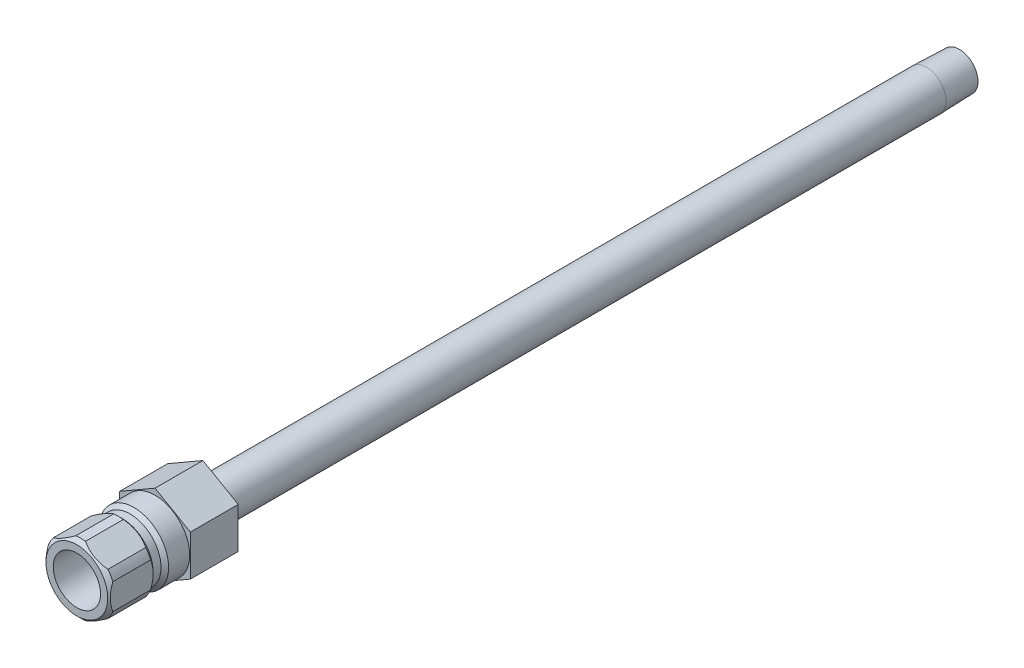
ISO-10303-21;
HEADER;
FILE_DESCRIPTION(('STEP AP214'),'2;1');
FILE_NAME('part.step','',(''),(''),'','','');
FILE_SCHEMA(('AUTOMOTIVE_DESIGN { 1 0 10303 214 1 1 1 1 }'));
ENDSEC;
DATA;
#1=APPLICATION_CONTEXT('core data for automotive mechanical design processes');
#2=APPLICATION_PROTOCOL_DEFINITION('international standard','automotive_design',2000,#1);
#3=PRODUCT_CONTEXT('',#1,'mechanical');
#4=PRODUCT('Part','Part','',(#3));
#5=PRODUCT_RELATED_PRODUCT_CATEGORY('part','',(#4));
#6=PRODUCT_DEFINITION_FORMATION('','',#4);
#7=PRODUCT_DEFINITION_CONTEXT('part definition',#1,'design');
#8=PRODUCT_DEFINITION('design','',#6,#7);
#9=PRODUCT_DEFINITION_SHAPE('','',#8);
#10=(LENGTH_UNIT() NAMED_UNIT(*) SI_UNIT(.MILLI.,.METRE.));
#11=(NAMED_UNIT(*) PLANE_ANGLE_UNIT() SI_UNIT($,.RADIAN.));
#12=(NAMED_UNIT(*) SI_UNIT($,.STERADIAN.) SOLID_ANGLE_UNIT());
#13=UNCERTAINTY_MEASURE_WITH_UNIT(LENGTH_MEASURE(1.E-05),#10,'distance_accuracy_value','');
#14=(GEOMETRIC_REPRESENTATION_CONTEXT(3) GLOBAL_UNCERTAINTY_ASSIGNED_CONTEXT((#13)) GLOBAL_UNIT_ASSIGNED_CONTEXT((#10,
#11,#12)) REPRESENTATION_CONTEXT('',''));
#15=CARTESIAN_POINT('',(0.,0.,0.));
#16=DIRECTION('',(0.,0.,1.));
#17=DIRECTION('',(1.,0.,0.));
#18=AXIS2_PLACEMENT_3D('',#15,#16,#17);
#19=CARTESIAN_POINT('',(0.,0.,-9.652));
#20=DIRECTION('',(0.,0.,-1.));
#21=DIRECTION('',(0.,1.,0.));
#22=AXIS2_PLACEMENT_3D('',#19,#20,#21);
#23=CYLINDRICAL_SURFACE('',#22,6.985);
#24=DIRECTION('',(0.,0.,-1.));
#25=VECTOR('',#24,1.);
#26=CARTESIAN_POINT('',(6.477,2.61509005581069,-9.652));
#27=LINE('',#26,#25);
#28=CARTESIAN_POINT('',(6.477,2.61509005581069,7.366));
#29=VERTEX_POINT('',#28);
#30=CARTESIAN_POINT('',(6.477,2.61509005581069,14.986));
#31=VERTEX_POINT('',#30);
#32=EDGE_CURVE('E381',#29,#31,#27,.F.);
#33=ORIENTED_EDGE('',*,*,#32,.F.);
#34=CARTESIAN_POINT('',(0.,0.,7.366));
#35=DIRECTION('',(0.,0.,-1.));
#36=DIRECTION('',(0.,1.,0.));
#37=AXIS2_PLACEMENT_3D('',#34,#35,#36);
#38=CIRCLE('',#37,6.985);
#39=CARTESIAN_POINT('',(5.50323442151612,4.30170151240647,7.366));
#40=VERTEX_POINT('',#39);
#41=EDGE_CURVE('E190',#40,#29,#38,.T.);
#42=ORIENTED_EDGE('',*,*,#41,.F.);
#43=DIRECTION('',(0.,0.,-1.));
#44=VECTOR('',#43,1.);
#45=CARTESIAN_POINT('',(5.50323442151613,4.30170151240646,-9.652));
#46=LINE('',#45,#44);
#47=CARTESIAN_POINT('',(5.50323442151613,4.30170151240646,14.986));
#48=VERTEX_POINT('',#47);
#49=EDGE_CURVE('E372',#48,#40,#46,.T.);
#50=ORIENTED_EDGE('',*,*,#49,.F.);
#51=CARTESIAN_POINT('',(0.,0.,14.986));
#52=DIRECTION('',(0.,0.,-1.));
#53=DIRECTION('',(0.,1.,0.));
#54=AXIS2_PLACEMENT_3D('',#51,#52,#53);
#55=CIRCLE('',#54,6.985);
#56=EDGE_CURVE('E205',#48,#31,#55,.T.);
#57=ORIENTED_EDGE('',*,*,#56,.T.);
#58=EDGE_LOOP('',(#33,#42,#50,#57));
#59=FACE_BOUND('',#58,.T.);
#60=ADVANCED_FACE('F34',(#59),#23,.T.);
#61=DIRECTION('',(0.,0.,-1.));
#62=VECTOR('',#61,1.);
#63=CARTESIAN_POINT('',(0.973765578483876,6.91679156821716,-9.652));
#64=LINE('',#63,#62);
#65=CARTESIAN_POINT('',(0.973765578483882,6.91679156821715,7.366));
#66=VERTEX_POINT('',#65);
#67=CARTESIAN_POINT('',(0.973765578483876,6.91679156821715,14.986));
#68=VERTEX_POINT('',#67);
#69=EDGE_CURVE('E291',#66,#68,#64,.F.);
#70=ORIENTED_EDGE('',*,*,#69,.F.);
#71=CARTESIAN_POINT('',(-0.973765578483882,6.91679156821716,7.366));
#72=VERTEX_POINT('',#71);
#73=EDGE_CURVE('E194',#72,#66,#38,.T.);
#74=ORIENTED_EDGE('',*,*,#73,.F.);
#75=DIRECTION('',(0.,0.,-1.));
#76=VECTOR('',#75,1.);
#77=CARTESIAN_POINT('',(-0.973765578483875,6.91679156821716,-9.652));
#78=LINE('',#77,#76);
#79=CARTESIAN_POINT('',(-0.973765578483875,6.91679156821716,14.986));
#80=VERTEX_POINT('',#79);
#81=EDGE_CURVE('E54',#80,#72,#78,.T.);
#82=ORIENTED_EDGE('',*,*,#81,.F.);
#83=EDGE_CURVE('E193',#80,#68,#55,.T.);
#84=ORIENTED_EDGE('',*,*,#83,.T.);
#85=EDGE_LOOP('',(#70,#74,#82,#84));
#86=FACE_BOUND('',#85,.T.);
#87=ADVANCED_FACE('F325',(#86),#23,.T.);
#88=DIRECTION('',(0.,0.,-1.));
#89=VECTOR('',#88,1.);
#90=CARTESIAN_POINT('',(-5.50323442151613,4.30170151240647,-9.652));
#91=LINE('',#90,#89);
#92=CARTESIAN_POINT('',(-5.50323442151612,4.30170151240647,7.366));
#93=VERTEX_POINT('',#92);
#94=CARTESIAN_POINT('',(-5.50323442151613,4.30170151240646,14.986));
#95=VERTEX_POINT('',#94);
#96=EDGE_CURVE('E370',#93,#95,#91,.F.);
#97=ORIENTED_EDGE('',*,*,#96,.F.);
#98=CARTESIAN_POINT('',(-6.477,2.6150900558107,7.366));
#99=VERTEX_POINT('',#98);
#100=EDGE_CURVE('E199',#99,#93,#38,.T.);
#101=ORIENTED_EDGE('',*,*,#100,.F.);
#102=DIRECTION('',(0.,0.,-1.));
#103=VECTOR('',#102,1.);
#104=CARTESIAN_POINT('',(-6.477,2.6150900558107,-9.652));
#105=LINE('',#104,#103);
#106=CARTESIAN_POINT('',(-6.477,2.61509005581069,14.986));
#107=VERTEX_POINT('',#106);
#108=EDGE_CURVE('E62',#107,#99,#105,.T.);
#109=ORIENTED_EDGE('',*,*,#108,.F.);
#110=EDGE_CURVE('E204',#107,#95,#55,.T.);
#111=ORIENTED_EDGE('',*,*,#110,.T.);
#112=EDGE_LOOP('',(#97,#101,#109,#111));
#113=FACE_BOUND('',#112,.T.);
#114=ADVANCED_FACE('F330',(#113),#23,.T.);
#115=DIRECTION('',(0.,0.,-1.));
#116=VECTOR('',#115,1.);
#117=CARTESIAN_POINT('',(-6.477,-2.6150900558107,-9.652));
#118=LINE('',#117,#116);
#119=CARTESIAN_POINT('',(-6.477,-2.6150900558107,7.366));
#120=VERTEX_POINT('',#119);
#121=CARTESIAN_POINT('',(-6.477,-2.6150900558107,14.986));
#122=VERTEX_POINT('',#121);
#123=EDGE_CURVE('E362',#120,#122,#118,.F.);
#124=ORIENTED_EDGE('',*,*,#123,.F.);
#125=CARTESIAN_POINT('',(-5.50323442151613,-4.30170151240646,7.366));
#126=VERTEX_POINT('',#125);
#127=EDGE_CURVE('E195',#126,#120,#38,.T.);
#128=ORIENTED_EDGE('',*,*,#127,.F.);
#129=DIRECTION('',(0.,0.,-1.));
#130=VECTOR('',#129,1.);
#131=CARTESIAN_POINT('',(-5.50323442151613,-4.30170151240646,-9.652));
#132=LINE('',#131,#130);
#133=CARTESIAN_POINT('',(-5.50323442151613,-4.30170151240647,14.986));
#134=VERTEX_POINT('',#133);
#135=EDGE_CURVE('E245',#134,#126,#132,.T.);
#136=ORIENTED_EDGE('',*,*,#135,.F.);
#137=EDGE_CURVE('E376',#134,#122,#55,.T.);
#138=ORIENTED_EDGE('',*,*,#137,.T.);
#139=EDGE_LOOP('',(#124,#128,#136,#138));
#140=FACE_BOUND('',#139,.T.);
#141=ADVANCED_FACE('F340',(#140),#23,.T.);
#142=DIRECTION('',(0.,0.,-1.));
#143=VECTOR('',#142,1.);
#144=CARTESIAN_POINT('',(-0.97376557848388,-6.91679156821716,-9.652));
#145=LINE('',#144,#143);
#146=CARTESIAN_POINT('',(-0.973765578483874,-6.91679156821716,7.366));
#147=VERTEX_POINT('',#146);
#148=CARTESIAN_POINT('',(-0.97376557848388,-6.91679156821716,14.986));
#149=VERTEX_POINT('',#148);
#150=EDGE_CURVE('E351',#147,#149,#145,.F.);
#151=ORIENTED_EDGE('',*,*,#150,.F.);
#152=CARTESIAN_POINT('',(0.973765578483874,-6.91679156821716,7.366));
#153=VERTEX_POINT('',#152);
#154=EDGE_CURVE('E191',#153,#147,#38,.T.);
#155=ORIENTED_EDGE('',*,*,#154,.F.);
#156=DIRECTION('',(0.,0.,-1.));
#157=VECTOR('',#156,1.);
#158=CARTESIAN_POINT('',(0.973765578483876,-6.91679156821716,-9.652));
#159=LINE('',#158,#157);
#160=CARTESIAN_POINT('',(0.973765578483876,-6.91679156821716,14.986));
#161=VERTEX_POINT('',#160);
#162=EDGE_CURVE('E168',#161,#153,#159,.T.);
#163=ORIENTED_EDGE('',*,*,#162,.F.);
#164=EDGE_CURVE('E353',#161,#149,#55,.T.);
#165=ORIENTED_EDGE('',*,*,#164,.T.);
#166=EDGE_LOOP('',(#151,#155,#163,#165));
#167=FACE_BOUND('',#166,.T.);
#168=ADVANCED_FACE('F334',(#167),#23,.T.);
#169=CARTESIAN_POINT('',(0.,0.,-9.652));
#170=DIRECTION('',(0.,0.,-1.));
#171=DIRECTION('',(0.,1.,0.));
#172=AXIS2_PLACEMENT_3D('',#169,#170,#171);
#173=CYLINDRICAL_SURFACE('',#172,2.65430000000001);
#174=CARTESIAN_POINT('',(0.,0.,2.43505017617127));
#175=DIRECTION('',(0.,0.,-1.));
#176=DIRECTION('',(0.,1.,0.));
#177=AXIS2_PLACEMENT_3D('',#174,#175,#176);
#178=CIRCLE('',#177,2.6543);
#179=CARTESIAN_POINT('',(0.,2.6543,2.43505017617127));
#180=VERTEX_POINT('',#179);
#181=EDGE_CURVE('E215',#180,#180,#178,.T.);
#182=ORIENTED_EDGE('',*,*,#181,.F.);
#183=EDGE_LOOP('',(#182));
#184=FACE_BOUND('',#183,.T.);
#185=CARTESIAN_POINT('',(0.,0.,-162.052));
#186=DIRECTION('',(0.,0.,-1.));
#187=DIRECTION('',(0.,1.,0.));
#188=AXIS2_PLACEMENT_3D('',#185,#186,#187);
#189=CIRCLE('',#188,2.65430000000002);
#190=CARTESIAN_POINT('',(0.,2.65430000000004,-162.052));
#191=VERTEX_POINT('',#190);
#192=EDGE_CURVE('E429',#191,#191,#189,.T.);
#193=ORIENTED_EDGE('',*,*,#192,.T.);
#194=EDGE_LOOP('',(#193));
#195=FACE_BOUND('',#194,.T.);
#196=ADVANCED_FACE('F36',(#184,#195),#173,.F.);
#197=CARTESIAN_POINT('',(0.,0.,3.556));
#198=DIRECTION('',(0.,0.,1.));
#199=DIRECTION('',(0.,-1.,0.));
#200=AXIS2_PLACEMENT_3D('',#197,#198,#199);
#201=CONICAL_SURFACE('',#200,4.7625,1.08210413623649);
#202=ORIENTED_EDGE('',*,*,#181,.T.);
#203=EDGE_LOOP('',(#202));
#204=FACE_BOUND('',#203,.T.);
#205=CARTESIAN_POINT('',(0.,0.,3.556));
#206=DIRECTION('',(0.,0.,-1.));
#207=DIRECTION('',(0.,1.,0.));
#208=AXIS2_PLACEMENT_3D('',#205,#206,#207);
#209=CIRCLE('',#208,4.7625);
#210=CARTESIAN_POINT('',(0.,4.7625,3.556));
#211=VERTEX_POINT('',#210);
#212=EDGE_CURVE('E212',#211,#211,#209,.T.);
#213=ORIENTED_EDGE('',*,*,#212,.F.);
#214=EDGE_LOOP('',(#213));
#215=FACE_BOUND('',#214,.T.);
#216=ADVANCED_FACE('F346',(#204,#215),#201,.F.);
#217=CARTESIAN_POINT('',(0.,0.,-9.652));
#218=DIRECTION('',(0.,0.,-1.));
#219=DIRECTION('',(0.,1.,0.));
#220=AXIS2_PLACEMENT_3D('',#217,#218,#219);
#221=CYLINDRICAL_SURFACE('',#220,4.7625);
#222=ORIENTED_EDGE('',*,*,#212,.T.);
#223=EDGE_LOOP('',(#222));
#224=FACE_BOUND('',#223,.T.);
#225=CARTESIAN_POINT('',(0.,0.,15.748));
#226=DIRECTION('',(0.,0.,-1.));
#227=DIRECTION('',(0.,1.,0.));
#228=AXIS2_PLACEMENT_3D('',#225,#226,#227);
#229=CIRCLE('',#228,4.7625);
#230=CARTESIAN_POINT('',(0.,4.7625,15.748));
#231=VERTEX_POINT('',#230);
#232=EDGE_CURVE('E209',#231,#231,#229,.T.);
#233=ORIENTED_EDGE('',*,*,#232,.F.);
#234=EDGE_LOOP('',(#233));
#235=FACE_BOUND('',#234,.T.);
#236=ADVANCED_FACE('F671',(#224,#235),#221,.F.);
#237=CARTESIAN_POINT('',(0.,4.7625,15.748));
#238=DIRECTION('',(0.,0.,1.));
#239=DIRECTION('',(0.,-1.,0.));
#240=AXIS2_PLACEMENT_3D('',#237,#238,#239);
#241=PLANE('',#240);
#242=ORIENTED_EDGE('',*,*,#232,.T.);
#243=EDGE_LOOP('',(#242));
#244=FACE_BOUND('',#243,.T.);
#245=CARTESIAN_POINT('',(0.,0.,15.748));
#246=DIRECTION('',(0.,0.,-1.));
#247=DIRECTION('',(0.,1.,0.));
#248=AXIS2_PLACEMENT_3D('',#245,#246,#247);
#249=CIRCLE('',#248,6.223);
#250=CARTESIAN_POINT('',(0.,6.223,15.748));
#251=VERTEX_POINT('',#250);
#252=EDGE_CURVE('E206',#251,#251,#249,.T.);
#253=ORIENTED_EDGE('',*,*,#252,.F.);
#254=EDGE_LOOP('',(#253));
#255=FACE_BOUND('',#254,.T.);
#256=ADVANCED_FACE('F252',(#244,#255),#241,.T.);
#257=CARTESIAN_POINT('',(0.,0.,14.986));
#258=DIRECTION('',(0.,0.,-1.));
#259=DIRECTION('',(0.,1.,0.));
#260=AXIS2_PLACEMENT_3D('',#257,#258,#259);
#261=CONICAL_SURFACE('',#260,6.985,0.785398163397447);
#262=CARTESIAN_POINT('',(6.477,-7.50531717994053,12.0573066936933));
#263=CARTESIAN_POINT('',(6.477,-7.32278230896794,12.1954662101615));
#264=CARTESIAN_POINT('',(6.477,-7.13923073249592,12.3323042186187));
#265=CARTESIAN_POINT('',(6.477,-6.76969107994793,12.6027438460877));
#266=CARTESIAN_POINT('',(6.477,-6.58370240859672,12.7363446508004));
#267=CARTESIAN_POINT('',(6.477,-6.20752484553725,13.0006667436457));
#268=CARTESIAN_POINT('',(6.477,-6.01731457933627,13.1313577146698));
#269=CARTESIAN_POINT('',(6.477,-5.63367369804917,13.3879087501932));
#270=CARTESIAN_POINT('',(6.477,-5.44024331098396,13.5137691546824));
#271=CARTESIAN_POINT('',(6.477,-5.03831720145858,13.7667102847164));
#272=CARTESIAN_POINT('',(6.477,-4.8295984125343,13.8934383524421));
#273=CARTESIAN_POINT('',(6.477,-4.40728395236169,14.1386241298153));
#274=CARTESIAN_POINT('',(6.477,-4.19368750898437,14.2570805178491));
#275=CARTESIAN_POINT('',(6.477,-3.7616267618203,14.4831715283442));
#276=CARTESIAN_POINT('',(6.477,-3.54317924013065,14.5908379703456));
#277=CARTESIAN_POINT('',(6.477,-3.100295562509,14.7929384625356));
#278=CARTESIAN_POINT('',(6.477,-2.87586219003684,14.8873785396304));
#279=CARTESIAN_POINT('',(6.477,-2.43955826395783,15.0524966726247));
#280=CARTESIAN_POINT('',(6.477,-2.22819339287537,15.1244971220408));
#281=CARTESIAN_POINT('',(6.477,-1.80033354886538,15.2515475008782));
#282=CARTESIAN_POINT('',(6.477,-1.58383822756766,15.3065962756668));
#283=CARTESIAN_POINT('',(6.477,-1.1506339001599,15.3959385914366));
#284=CARTESIAN_POINT('',(6.477,-0.934000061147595,15.4305906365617));
#285=CARTESIAN_POINT('',(6.477,-0.498364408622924,15.4784594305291));
#286=CARTESIAN_POINT('',(6.477,-0.279363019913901,15.4916799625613));
#287=CARTESIAN_POINT('',(6.477,0.150697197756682,15.4956835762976));
#288=CARTESIAN_POINT('',(6.477,0.361748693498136,15.4872823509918));
#289=CARTESIAN_POINT('',(6.477,0.782066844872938,15.4503172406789));
#290=CARTESIAN_POINT('',(6.477,0.991333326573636,15.421751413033));
#291=CARTESIAN_POINT('',(6.477,1.41010575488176,15.3455375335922));
#292=CARTESIAN_POINT('',(6.477,1.6195513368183,15.2975631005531));
#293=CARTESIAN_POINT('',(6.477,2.03387291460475,15.1851046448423));
#294=CARTESIAN_POINT('',(6.477,2.2387492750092,15.1206219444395));
#295=CARTESIAN_POINT('',(6.477,2.66141718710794,14.9715598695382));
#296=CARTESIAN_POINT('',(6.477,2.87875617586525,14.8857103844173));
#297=CARTESIAN_POINT('',(6.477,3.30779766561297,14.7008180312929));
#298=CARTESIAN_POINT('',(6.477,3.51949749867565,14.6017690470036));
#299=CARTESIAN_POINT('',(6.477,3.9382898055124,14.3928329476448));
#300=CARTESIAN_POINT('',(6.477,4.14536521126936,14.282911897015));
#301=CARTESIAN_POINT('',(6.477,4.55475391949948,14.0546596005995));
#302=CARTESIAN_POINT('',(6.477,4.75706796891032,13.93632968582));
#303=CARTESIAN_POINT('',(6.477,5.14761370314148,13.6989609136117));
#304=CARTESIAN_POINT('',(6.477,5.33604552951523,13.580249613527));
#305=CARTESIAN_POINT('',(6.477,5.70967381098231,13.3378251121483));
#306=CARTESIAN_POINT('',(6.477,5.89487001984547,13.2141115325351));
#307=CARTESIAN_POINT('',(6.477,6.26095063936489,12.9635958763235));
#308=CARTESIAN_POINT('',(6.477,6.44185783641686,12.8368269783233));
#309=CARTESIAN_POINT('',(6.477,6.80119835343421,12.5799293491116));
#310=CARTESIAN_POINT('',(6.477,6.97963234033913,12.4498015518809));
#311=CARTESIAN_POINT('',(6.477,7.15703038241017,12.3183002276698));
#312=B_SPLINE_CURVE_WITH_KNOTS('',3,(#262,#263,#264,#265,#266,#267,#268,#269,#270,#271,#272,
#273,#274,#275,#276,#277,#278,#279,#280,#281,#282,#283,#284,#285,#286,#287,#288,#289,#290,#291,
#292,#293,#294,#295,#296,#297,#298,#299,#300,#301,#302,#303,#304,#305,#306,#307,#308,#309,#310,
#311),.UNSPECIFIED.,.F.,.F.,(4,2,2,2,2,2,2,2,2,2,2,2,2,2,2,2,2,2,2,2,2,2,2,2,4),(0.,
0.686790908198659,1.37375281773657,2.06603541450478,2.75826919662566,3.49065471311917,
4.22315698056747,4.95343127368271,5.68337170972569,6.35265989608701,7.02199365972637,
7.67918147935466,8.33625327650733,8.96890298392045,9.6016136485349,10.2454384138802,
10.8892116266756,11.5897073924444,12.2905288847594,12.9936114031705,13.6965828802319,
14.3646145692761,15.0326968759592,15.6953618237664,16.3578444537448),.UNSPECIFIED.);
#313=CARTESIAN_POINT('',(6.477,-2.61509005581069,14.986));
#314=VERTEX_POINT('',#313);
#315=EDGE_CURVE('E384',#31,#314,#312,.F.);
#316=ORIENTED_EDGE('',*,*,#315,.F.);
#317=ORIENTED_EDGE('',*,*,#56,.F.);
#318=CARTESIAN_POINT('',(0.973302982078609,6.91705864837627,14.9858));
#319=CARTESIAN_POINT('',(1.15430521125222,6.81255696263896,15.0641166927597));
#320=CARTESIAN_POINT('',(1.33782092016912,6.70660411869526,15.1353544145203));
#321=CARTESIAN_POINT('',(1.70963160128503,6.49193912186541,15.2608524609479));
#322=CARTESIAN_POINT('',(1.89793754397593,6.38322063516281,15.3150691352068));
#323=CARTESIAN_POINT('',(2.27146153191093,6.16756646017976,15.401724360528));
#324=CARTESIAN_POINT('',(2.45655498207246,6.06070270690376,15.4348622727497));
#325=CARTESIAN_POINT('',(2.82844640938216,5.8459910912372,15.4802195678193));
#326=CARTESIAN_POINT('',(3.01524193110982,5.73814464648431,15.4924653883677));
#327=CARTESIAN_POINT('',(3.39480578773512,5.51900335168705,15.4953056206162));
#328=CARTESIAN_POINT('',(3.58757842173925,5.40770601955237,15.4852117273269));
#329=CARTESIAN_POINT('',(3.97148128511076,5.18605959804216,15.4426708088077));
#330=CARTESIAN_POINT('',(4.16260891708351,5.07571200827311,15.4101933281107));
#331=CARTESIAN_POINT('',(4.54854122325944,4.85289388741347,15.3234273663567));
#332=CARTESIAN_POINT('',(4.74321398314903,4.74049951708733,15.268364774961));
#333=CARTESIAN_POINT('',(5.03141021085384,4.57410934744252,15.1720079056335));
#334=CARTESIAN_POINT('',(5.12673323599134,4.51907457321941,15.1376422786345));
#335=CARTESIAN_POINT('',(5.31613879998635,4.40972121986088,15.0647445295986));
#336=CARTESIAN_POINT('',(5.41022179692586,4.35540237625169,15.0262139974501));
#337=CARTESIAN_POINT('',(5.5036970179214,4.30143443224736,14.9858));
#338=B_SPLINE_CURVE_WITH_KNOTS('',3,(#318,#319,#320,#321,#322,#323,#324,#325,#326,#327,#328,
#329,#330,#331,#332,#333,#334,#335,#336,#337),.UNSPECIFIED.,.F.,.F.,(4,2,2,2,2,2,2,2,2,4),(0.,
0.669810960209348,1.34132587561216,1.9892054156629,2.63626449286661,3.30353665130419,
3.97171850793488,4.6650216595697,5.01088265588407,5.3566120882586),.UNSPECIFIED.);
#339=EDGE_CURVE('E283',#68,#48,#338,.T.);
#340=ORIENTED_EDGE('',*,*,#339,.F.);
#341=ORIENTED_EDGE('',*,*,#83,.F.);
#342=CARTESIAN_POINT('',(-5.50369701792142,4.30143443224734,14.9858));
#343=CARTESIAN_POINT('',(-5.32269478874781,4.40593611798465,15.0641166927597));
#344=CARTESIAN_POINT('',(-5.1391790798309,4.51188896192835,15.1353544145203));
#345=CARTESIAN_POINT('',(-4.76736839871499,4.7265539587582,15.2608524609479));
#346=CARTESIAN_POINT('',(-4.57906245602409,4.8352724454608,15.3150691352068));
#347=CARTESIAN_POINT('',(-4.20553846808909,5.05092662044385,15.401724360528));
#348=CARTESIAN_POINT('',(-4.02044501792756,5.15779037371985,15.4348622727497));
#349=CARTESIAN_POINT('',(-3.64855359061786,5.37250198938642,15.4802195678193));
#350=CARTESIAN_POINT('',(-3.4617580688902,5.4803484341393,15.4924653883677));
#351=CARTESIAN_POINT('',(-3.0821942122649,5.69948972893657,15.4953056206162));
#352=CARTESIAN_POINT('',(-2.88942157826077,5.81078706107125,15.4852117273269));
#353=CARTESIAN_POINT('',(-2.50551871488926,6.03243348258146,15.4426708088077));
#354=CARTESIAN_POINT('',(-2.3143910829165,6.1427810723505,15.4101933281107));
#355=CARTESIAN_POINT('',(-1.92845877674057,6.36559919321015,15.3234273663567));
#356=CARTESIAN_POINT('',(-1.73378601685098,6.47799356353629,15.268364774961));
#357=CARTESIAN_POINT('',(-1.44558978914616,6.6443837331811,15.1720079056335));
#358=CARTESIAN_POINT('',(-1.35026676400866,6.69941850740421,15.1376422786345));
#359=CARTESIAN_POINT('',(-1.16086120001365,6.80877186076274,15.0647445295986));
#360=CARTESIAN_POINT('',(-1.06677820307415,6.86309070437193,15.0262139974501));
#361=CARTESIAN_POINT('',(-0.973302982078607,6.91705864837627,14.9858));
#362=B_SPLINE_CURVE_WITH_KNOTS('',3,(#342,#343,#344,#345,#346,#347,#348,#349,#350,#351,#352,
#353,#354,#355,#356,#357,#358,#359,#360,#361),.UNSPECIFIED.,.F.,.F.,(4,2,2,2,2,2,2,2,2,4),(0.,
0.669810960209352,1.34132587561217,1.98920541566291,2.63626449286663,3.30353665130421,
3.9717185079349,4.66502165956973,5.0108826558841,5.35661208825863),.UNSPECIFIED.);
#363=EDGE_CURVE('E275',#95,#80,#362,.T.);
#364=ORIENTED_EDGE('',*,*,#363,.F.);
#365=ORIENTED_EDGE('',*,*,#110,.F.);
#366=CARTESIAN_POINT('',(-6.477,-7.50531717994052,12.0573066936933));
#367=CARTESIAN_POINT('',(-6.477,-7.32278230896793,12.1954662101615));
#368=CARTESIAN_POINT('',(-6.477,-7.13923073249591,12.3323042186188));
#369=CARTESIAN_POINT('',(-6.477,-6.76969107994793,12.6027438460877));
#370=CARTESIAN_POINT('',(-6.477,-6.58370240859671,12.7363446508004));
#371=CARTESIAN_POINT('',(-6.477,-6.20752484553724,13.0006667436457));
#372=CARTESIAN_POINT('',(-6.477,-6.01731457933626,13.1313577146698));
#373=CARTESIAN_POINT('',(-6.477,-5.63367369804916,13.3879087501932));
#374=CARTESIAN_POINT('',(-6.477,-5.44024331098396,13.5137691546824));
#375=CARTESIAN_POINT('',(-6.477,-5.03831720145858,13.7667102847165));
#376=CARTESIAN_POINT('',(-6.477,-4.82959841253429,13.8934383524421));
#377=CARTESIAN_POINT('',(-6.477,-4.40728395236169,14.1386241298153));
#378=CARTESIAN_POINT('',(-6.477,-4.19368750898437,14.2570805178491));
#379=CARTESIAN_POINT('',(-6.477,-3.7616267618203,14.4831715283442));
#380=CARTESIAN_POINT('',(-6.477,-3.54317924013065,14.5908379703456));
#381=CARTESIAN_POINT('',(-6.477,-3.100295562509,14.7929384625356));
#382=CARTESIAN_POINT('',(-6.477,-2.87586219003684,14.8873785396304));
#383=CARTESIAN_POINT('',(-6.477,-2.43955826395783,15.0524966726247));
#384=CARTESIAN_POINT('',(-6.477,-2.22819339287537,15.1244971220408));
#385=CARTESIAN_POINT('',(-6.477,-1.80033354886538,15.2515475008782));
#386=CARTESIAN_POINT('',(-6.477,-1.58383822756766,15.3065962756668));
#387=CARTESIAN_POINT('',(-6.477,-1.15063390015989,15.3959385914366));
#388=CARTESIAN_POINT('',(-6.477,-0.934000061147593,15.4305906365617));
#389=CARTESIAN_POINT('',(-6.477,-0.498364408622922,15.4784594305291));
#390=CARTESIAN_POINT('',(-6.477,-0.279363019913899,15.4916799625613));
#391=CARTESIAN_POINT('',(-6.477,0.150697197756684,15.4956835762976));
#392=CARTESIAN_POINT('',(-6.477,0.361748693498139,15.4872823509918));
#393=CARTESIAN_POINT('',(-6.477,0.78206684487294,15.4503172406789));
#394=CARTESIAN_POINT('',(-6.477,0.991333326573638,15.421751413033));
#395=CARTESIAN_POINT('',(-6.477,1.41010575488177,15.3455375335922));
#396=CARTESIAN_POINT('',(-6.477,1.6195513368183,15.2975631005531));
#397=CARTESIAN_POINT('',(-6.477,2.03387291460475,15.1851046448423));
#398=CARTESIAN_POINT('',(-6.477,2.2387492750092,15.1206219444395));
#399=CARTESIAN_POINT('',(-6.477,2.66141718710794,14.9715598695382));
#400=CARTESIAN_POINT('',(-6.477,2.87875617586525,14.8857103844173));
#401=CARTESIAN_POINT('',(-6.477,3.30779766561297,14.7008180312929));
#402=CARTESIAN_POINT('',(-6.477,3.51949749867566,14.6017690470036));
#403=CARTESIAN_POINT('',(-6.477,3.9382898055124,14.3928329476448));
#404=CARTESIAN_POINT('',(-6.477,4.14536521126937,14.282911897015));
#405=CARTESIAN_POINT('',(-6.477,4.55475391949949,14.0546596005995));
#406=CARTESIAN_POINT('',(-6.477,4.75706796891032,13.93632968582));
#407=CARTESIAN_POINT('',(-6.477,5.14761370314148,13.6989609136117));
#408=CARTESIAN_POINT('',(-6.477,5.33604552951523,13.580249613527));
#409=CARTESIAN_POINT('',(-6.477,5.70967381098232,13.3378251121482));
#410=CARTESIAN_POINT('',(-6.477,5.89487001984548,13.2141115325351));
#411=CARTESIAN_POINT('',(-6.477,6.26095063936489,12.9635958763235));
#412=CARTESIAN_POINT('',(-6.477,6.44185783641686,12.8368269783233));
#413=CARTESIAN_POINT('',(-6.477,6.80119835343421,12.5799293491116));
#414=CARTESIAN_POINT('',(-6.477,6.97963234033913,12.4498015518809));
#415=CARTESIAN_POINT('',(-6.477,7.15703038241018,12.3183002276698));
#416=B_SPLINE_CURVE_WITH_KNOTS('',3,(#366,#367,#368,#369,#370,#371,#372,#373,#374,#375,#376,
#377,#378,#379,#380,#381,#382,#383,#384,#385,#386,#387,#388,#389,#390,#391,#392,#393,#394,#395,
#396,#397,#398,#399,#400,#401,#402,#403,#404,#405,#406,#407,#408,#409,#410,#411,#412,#413,#414,
#415),.UNSPECIFIED.,.F.,.F.,(4,2,2,2,2,2,2,2,2,2,2,2,2,2,2,2,2,2,2,2,2,2,2,2,4),(0.,
0.686790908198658,1.37375281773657,2.06603541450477,2.75826919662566,3.49065471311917,
4.22315698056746,4.95343127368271,5.68337170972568,6.352659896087,7.02199365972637,
7.67918147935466,8.33625327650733,8.96890298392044,9.6016136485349,10.2454384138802,
10.8892116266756,11.5897073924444,12.2905288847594,12.9936114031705,13.6965828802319,
14.3646145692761,15.0326968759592,15.6953618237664,16.3578444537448),.UNSPECIFIED.);
#417=EDGE_CURVE('E268',#122,#107,#416,.T.);
#418=ORIENTED_EDGE('',*,*,#417,.F.);
#419=ORIENTED_EDGE('',*,*,#137,.F.);
#420=CARTESIAN_POINT('',(-0.973302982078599,-6.91705864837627,14.9858));
#421=CARTESIAN_POINT('',(-1.15430521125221,-6.81255696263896,15.0641166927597));
#422=CARTESIAN_POINT('',(-1.33782092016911,-6.70660411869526,15.1353544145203));
#423=CARTESIAN_POINT('',(-1.70963160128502,-6.49193912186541,15.2608524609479));
#424=CARTESIAN_POINT('',(-1.89793754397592,-6.38322063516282,15.3150691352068));
#425=CARTESIAN_POINT('',(-2.27146153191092,-6.16756646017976,15.401724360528));
#426=CARTESIAN_POINT('',(-2.45655498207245,-6.06070270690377,15.4348622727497));
#427=CARTESIAN_POINT('',(-2.82844640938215,-5.8459910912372,15.4802195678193));
#428=CARTESIAN_POINT('',(-3.01524193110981,-5.73814464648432,15.4924653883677));
#429=CARTESIAN_POINT('',(-3.39480578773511,-5.51900335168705,15.4953056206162));
#430=CARTESIAN_POINT('',(-3.58757842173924,-5.40770601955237,15.4852117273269));
#431=CARTESIAN_POINT('',(-3.97148128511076,-5.18605959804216,15.4426708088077));
#432=CARTESIAN_POINT('',(-4.16260891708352,-5.07571200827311,15.4101933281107));
#433=CARTESIAN_POINT('',(-4.54854122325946,-4.85289388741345,15.3234273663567));
#434=CARTESIAN_POINT('',(-4.74321398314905,-4.74049951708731,15.268364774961));
#435=CARTESIAN_POINT('',(-5.03141021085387,-4.5741093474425,15.1720079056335));
#436=CARTESIAN_POINT('',(-5.12673323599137,-4.51907457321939,15.1376422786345));
#437=CARTESIAN_POINT('',(-5.31613879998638,-4.40972121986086,15.0647445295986));
#438=CARTESIAN_POINT('',(-5.41022179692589,-4.35540237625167,15.0262139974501));
#439=CARTESIAN_POINT('',(-5.50369701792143,-4.30143443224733,14.9858));
#440=B_SPLINE_CURVE_WITH_KNOTS('',3,(#420,#421,#422,#423,#424,#425,#426,#427,#428,#429,#430,
#431,#432,#433,#434,#435,#436,#437,#438,#439),.UNSPECIFIED.,.F.,.F.,(4,2,2,2,2,2,2,2,2,4),(0.,
0.669810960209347,1.34132587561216,1.9892054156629,2.63626449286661,3.3035366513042,
3.97171850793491,4.66502165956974,5.01088265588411,5.35661208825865),.UNSPECIFIED.);
#441=EDGE_CURVE('E261',#149,#134,#440,.T.);
#442=ORIENTED_EDGE('',*,*,#441,.F.);
#443=ORIENTED_EDGE('',*,*,#164,.F.);
#444=CARTESIAN_POINT('',(5.5036970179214,-4.30143443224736,14.9858));
#445=CARTESIAN_POINT('',(5.32269478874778,-4.40593611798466,15.0641166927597));
#446=CARTESIAN_POINT('',(5.13917907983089,-4.51188896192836,15.1353544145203));
#447=CARTESIAN_POINT('',(4.76736839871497,-4.72655395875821,15.2608524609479));
#448=CARTESIAN_POINT('',(4.57906245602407,-4.83527244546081,15.3150691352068));
#449=CARTESIAN_POINT('',(4.20553846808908,-5.05092662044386,15.401724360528));
#450=CARTESIAN_POINT('',(4.02044501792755,-5.15779037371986,15.4348622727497));
#451=CARTESIAN_POINT('',(3.64855359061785,-5.37250198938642,15.4802195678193));
#452=CARTESIAN_POINT('',(3.46175806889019,-5.4803484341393,15.4924653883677));
#453=CARTESIAN_POINT('',(3.08219421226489,-5.69948972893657,15.4953056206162));
#454=CARTESIAN_POINT('',(2.88942157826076,-5.81078706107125,15.4852117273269));
#455=CARTESIAN_POINT('',(2.50551871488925,-6.03243348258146,15.4426708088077));
#456=CARTESIAN_POINT('',(2.31439108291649,-6.14278107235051,15.4101933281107));
#457=CARTESIAN_POINT('',(1.92845877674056,-6.36559919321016,15.3234273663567));
#458=CARTESIAN_POINT('',(1.73378601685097,-6.4779935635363,15.268364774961));
#459=CARTESIAN_POINT('',(1.44558978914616,-6.64438373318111,15.1720079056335));
#460=CARTESIAN_POINT('',(1.35026676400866,-6.69941850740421,15.1376422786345));
#461=CARTESIAN_POINT('',(1.16086120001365,-6.80877186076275,15.0647445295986));
#462=CARTESIAN_POINT('',(1.06677820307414,-6.86309070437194,15.0262139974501));
#463=CARTESIAN_POINT('',(0.973302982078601,-6.91705864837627,14.9858));
#464=B_SPLINE_CURVE_WITH_KNOTS('',3,(#444,#445,#446,#447,#448,#449,#450,#451,#452,#453,#454,
#455,#456,#457,#458,#459,#460,#461,#462,#463),.UNSPECIFIED.,.F.,.F.,(4,2,2,2,2,2,2,2,2,4),(0.,
0.669810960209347,1.34132587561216,1.9892054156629,2.63626449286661,3.30353665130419,
3.97171850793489,4.66502165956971,5.01088265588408,5.35661208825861),.UNSPECIFIED.);
#465=CARTESIAN_POINT('',(5.50323442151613,-4.30170151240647,14.986));
#466=VERTEX_POINT('',#465);
#467=EDGE_CURVE('E184',#466,#161,#464,.T.);
#468=ORIENTED_EDGE('',*,*,#467,.F.);
#469=EDGE_CURVE('E183',#314,#466,#55,.T.);
#470=ORIENTED_EDGE('',*,*,#469,.F.);
#471=EDGE_LOOP('',(#316,#317,#340,#341,#364,#365,#418,#419,#442,#443,#468,#470));
#472=FACE_BOUND('',#471,.T.);
#473=ORIENTED_EDGE('',*,*,#252,.T.);
#474=EDGE_LOOP('',(#473));
#475=FACE_BOUND('',#474,.T.);
#476=ADVANCED_FACE('F248',(#472,#475),#261,.T.);
#477=DIRECTION('',(0.,0.,-1.));
#478=VECTOR('',#477,1.);
#479=CARTESIAN_POINT('',(6.477,-2.61509005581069,-9.652));
#480=LINE('',#479,#478);
#481=CARTESIAN_POINT('',(6.477,-2.61509005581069,7.366));
#482=VERTEX_POINT('',#481);
#483=EDGE_CURVE('E290',#314,#482,#480,.T.);
#484=ORIENTED_EDGE('',*,*,#483,.F.);
#485=ORIENTED_EDGE('',*,*,#469,.T.);
#486=DIRECTION('',(0.,0.,-1.));
#487=VECTOR('',#486,1.);
#488=CARTESIAN_POINT('',(5.50323442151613,-4.30170151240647,-9.652));
#489=LINE('',#488,#487);
#490=CARTESIAN_POINT('',(5.50323442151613,-4.30170151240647,7.366));
#491=VERTEX_POINT('',#490);
#492=EDGE_CURVE('E165',#491,#466,#489,.F.);
#493=ORIENTED_EDGE('',*,*,#492,.F.);
#494=EDGE_CURVE('E181',#482,#491,#38,.T.);
#495=ORIENTED_EDGE('',*,*,#494,.F.);
#496=EDGE_LOOP('',(#484,#485,#493,#495));
#497=FACE_BOUND('',#496,.T.);
#498=ADVANCED_FACE('F180',(#497),#23,.T.);
#499=CARTESIAN_POINT('',(0.,0.,6.604));
#500=DIRECTION('',(0.,0.,1.));
#501=DIRECTION('',(0.,-1.,0.));
#502=AXIS2_PLACEMENT_3D('',#499,#500,#501);
#503=CONICAL_SURFACE('',#502,6.223,0.785398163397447);
#504=CARTESIAN_POINT('',(6.477,-7.50531717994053,10.2946933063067));
#505=CARTESIAN_POINT('',(6.477,-7.32278230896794,10.1565337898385));
#506=CARTESIAN_POINT('',(6.477,-7.13923073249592,10.0196957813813));
#507=CARTESIAN_POINT('',(6.477,-6.76969107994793,9.74925615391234));
#508=CARTESIAN_POINT('',(6.477,-6.58370240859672,9.61565534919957));
#509=CARTESIAN_POINT('',(6.477,-6.20752484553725,9.35133325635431));
#510=CARTESIAN_POINT('',(6.477,-6.01731457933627,9.22064228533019));
#511=CARTESIAN_POINT('',(6.477,-5.63367369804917,8.96409124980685));
#512=CARTESIAN_POINT('',(6.477,-5.44024331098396,8.83823084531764));
#513=CARTESIAN_POINT('',(6.477,-5.03831720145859,8.58528971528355));
#514=CARTESIAN_POINT('',(6.477,-4.8295984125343,8.45856164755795));
#515=CARTESIAN_POINT('',(6.477,-4.4072839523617,8.21337587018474));
#516=CARTESIAN_POINT('',(6.477,-4.19368750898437,8.09491948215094));
#517=CARTESIAN_POINT('',(6.477,-3.7616267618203,7.8688284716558));
#518=CARTESIAN_POINT('',(6.477,-3.54317924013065,7.76116202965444));
#519=CARTESIAN_POINT('',(6.477,-3.100295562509,7.55906153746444));
#520=CARTESIAN_POINT('',(6.477,-2.87586219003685,7.46462146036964));
#521=CARTESIAN_POINT('',(6.477,-2.43955826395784,7.2995033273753));
#522=CARTESIAN_POINT('',(6.477,-2.22819339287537,7.2275028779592));
#523=CARTESIAN_POINT('',(6.477,-1.80033354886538,7.1004524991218));
#524=CARTESIAN_POINT('',(6.477,-1.58383822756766,7.0454037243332));
#525=CARTESIAN_POINT('',(6.477,-1.1506339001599,6.95606140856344));
#526=CARTESIAN_POINT('',(6.477,-0.934000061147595,6.9214093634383));
#527=CARTESIAN_POINT('',(6.477,-0.498364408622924,6.87354056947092));
#528=CARTESIAN_POINT('',(6.477,-0.279363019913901,6.86032003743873));
#529=CARTESIAN_POINT('',(6.477,0.150697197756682,6.85631642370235));
#530=CARTESIAN_POINT('',(6.477,0.361748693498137,6.86471764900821));
#531=CARTESIAN_POINT('',(6.477,0.78206684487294,6.90168275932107));
#532=CARTESIAN_POINT('',(6.477,0.991333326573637,6.93024858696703));
#533=CARTESIAN_POINT('',(6.477,1.41010575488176,7.00646246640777));
#534=CARTESIAN_POINT('',(6.477,1.6195513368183,7.05443689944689));
#535=CARTESIAN_POINT('',(6.477,2.03387291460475,7.16689535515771));
#536=CARTESIAN_POINT('',(6.477,2.2387492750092,7.2313780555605));
#537=CARTESIAN_POINT('',(6.477,2.66141718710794,7.38044013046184));
#538=CARTESIAN_POINT('',(6.477,2.87875617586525,7.46628961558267));
#539=CARTESIAN_POINT('',(6.477,3.30779766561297,7.65118196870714));
#540=CARTESIAN_POINT('',(6.477,3.51949749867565,7.75023095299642));
#541=CARTESIAN_POINT('',(6.477,3.9382898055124,7.95916705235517));
#542=CARTESIAN_POINT('',(6.477,4.14536521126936,8.06908810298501));
#543=CARTESIAN_POINT('',(6.477,4.55475391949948,8.29734039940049));
#544=CARTESIAN_POINT('',(6.477,4.75706796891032,8.41567031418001));
#545=CARTESIAN_POINT('',(6.477,5.14761370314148,8.65303908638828));
#546=CARTESIAN_POINT('',(6.477,5.33604552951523,8.77175038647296));
#547=CARTESIAN_POINT('',(6.477,5.70967381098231,9.01417488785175));
#548=CARTESIAN_POINT('',(6.477,5.89487001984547,9.13788846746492));
#549=CARTESIAN_POINT('',(6.477,6.26095063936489,9.38840412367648));
#550=CARTESIAN_POINT('',(6.477,6.44185783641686,9.51517302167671));
#551=CARTESIAN_POINT('',(6.477,6.80119835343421,9.77207065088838));
#552=CARTESIAN_POINT('',(6.477,6.97963234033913,9.90219844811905));
#553=CARTESIAN_POINT('',(6.477,7.15703038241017,10.0336997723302));
#554=B_SPLINE_CURVE_WITH_KNOTS('',3,(#504,#505,#506,#507,#508,#509,#510,#511,#512,#513,#514,
#515,#516,#517,#518,#519,#520,#521,#522,#523,#524,#525,#526,#527,#528,#529,#530,#531,#532,#533,
#534,#535,#536,#537,#538,#539,#540,#541,#542,#543,#544,#545,#546,#547,#548,#549,#550,#551,#552,
#553),.UNSPECIFIED.,.F.,.F.,(4,2,2,2,2,2,2,2,2,2,2,2,2,2,2,2,2,2,2,2,2,2,2,2,4),(0.,
0.686790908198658,1.37375281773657,2.06603541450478,2.75826919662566,3.49065471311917,
4.22315698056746,4.95343127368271,5.68337170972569,6.35265989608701,7.02199365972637,
7.67918147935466,8.33625327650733,8.96890298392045,9.6016136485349,10.2454384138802,
10.8892116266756,11.5897073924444,12.2905288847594,12.9936114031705,13.6965828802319,
14.3646145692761,15.0326968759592,15.6953618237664,16.3578444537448),.UNSPECIFIED.);
#555=EDGE_CURVE('E12',#482,#29,#554,.T.);
#556=ORIENTED_EDGE('',*,*,#555,.F.);
#557=ORIENTED_EDGE('',*,*,#494,.T.);
#558=CARTESIAN_POINT('',(0.973302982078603,-6.91705864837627,7.3662));
#559=CARTESIAN_POINT('',(1.15430521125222,-6.81255696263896,7.28788330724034));
#560=CARTESIAN_POINT('',(1.33782092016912,-6.70660411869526,7.21664558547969));
#561=CARTESIAN_POINT('',(1.70963160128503,-6.49193912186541,7.09114753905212));
#562=CARTESIAN_POINT('',(1.89793754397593,-6.38322063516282,7.03693086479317));
#563=CARTESIAN_POINT('',(2.27146153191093,-6.16756646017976,6.95027563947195));
#564=CARTESIAN_POINT('',(2.45655498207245,-6.06070270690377,6.91713772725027));
#565=CARTESIAN_POINT('',(2.82844640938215,-5.8459910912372,6.87178043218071));
#566=CARTESIAN_POINT('',(3.01524193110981,-5.73814464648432,6.85953461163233));
#567=CARTESIAN_POINT('',(3.39480578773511,-5.51900335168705,6.85669437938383));
#568=CARTESIAN_POINT('',(3.58757842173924,-5.40770601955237,6.86678827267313));
#569=CARTESIAN_POINT('',(3.97148128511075,-5.18605959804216,6.90932919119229));
#570=CARTESIAN_POINT('',(4.16260891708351,-5.07571200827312,6.9418066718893));
#571=CARTESIAN_POINT('',(4.54854122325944,-4.85289388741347,7.02857263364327));
#572=CARTESIAN_POINT('',(4.74321398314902,-4.74049951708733,7.08363522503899));
#573=CARTESIAN_POINT('',(5.03141021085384,-4.57410934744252,7.17999209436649));
#574=CARTESIAN_POINT('',(5.12673323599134,-4.51907457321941,7.21435772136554));
#575=CARTESIAN_POINT('',(5.31613879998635,-4.40972121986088,7.28725547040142));
#576=CARTESIAN_POINT('',(5.41022179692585,-4.35540237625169,7.32578600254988));
#577=CARTESIAN_POINT('',(5.50369701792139,-4.30143443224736,7.3662));
#578=B_SPLINE_CURVE_WITH_KNOTS('',3,(#558,#559,#560,#561,#562,#563,#564,#565,#566,#567,#568,
#569,#570,#571,#572,#573,#574,#575,#576,#577),.UNSPECIFIED.,.F.,.F.,(4,2,2,2,2,2,2,2,2,4),(0.,
0.669810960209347,1.34132587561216,1.9892054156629,2.63626449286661,3.30353665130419,
3.97171850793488,4.6650216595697,5.01088265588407,5.3566120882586),.UNSPECIFIED.);
#579=EDGE_CURVE('E162',#153,#491,#578,.T.);
#580=ORIENTED_EDGE('',*,*,#579,.F.);
#581=ORIENTED_EDGE('',*,*,#154,.T.);
#582=CARTESIAN_POINT('',(-5.50369701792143,-4.30143443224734,7.36620000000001));
#583=CARTESIAN_POINT('',(-5.32269478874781,-4.40593611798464,7.28788330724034));
#584=CARTESIAN_POINT('',(-5.13917907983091,-4.51188896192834,7.2166455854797));
#585=CARTESIAN_POINT('',(-4.767368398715,-4.72655395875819,7.09114753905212));
#586=CARTESIAN_POINT('',(-4.5790624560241,-4.83527244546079,7.03693086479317));
#587=CARTESIAN_POINT('',(-4.2055384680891,-5.05092662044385,6.95027563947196));
#588=CARTESIAN_POINT('',(-4.02044501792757,-5.15779037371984,6.91713772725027));
#589=CARTESIAN_POINT('',(-3.64855359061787,-5.37250198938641,6.87178043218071));
#590=CARTESIAN_POINT('',(-3.46175806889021,-5.48034843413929,6.85953461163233));
#591=CARTESIAN_POINT('',(-3.08219421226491,-5.69948972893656,6.85669437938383));
#592=CARTESIAN_POINT('',(-2.88942157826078,-5.81078706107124,6.86678827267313));
#593=CARTESIAN_POINT('',(-2.50551871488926,-6.03243348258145,6.90932919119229));
#594=CARTESIAN_POINT('',(-2.3143910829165,-6.1427810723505,6.94180667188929));
#595=CARTESIAN_POINT('',(-1.92845877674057,-6.36559919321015,7.02857263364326));
#596=CARTESIAN_POINT('',(-1.73378601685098,-6.47799356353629,7.08363522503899));
#597=CARTESIAN_POINT('',(-1.44558978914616,-6.6443837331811,7.17999209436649));
#598=CARTESIAN_POINT('',(-1.35026676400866,-6.69941850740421,7.21435772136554));
#599=CARTESIAN_POINT('',(-1.16086120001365,-6.80877186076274,7.28725547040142));
#600=CARTESIAN_POINT('',(-1.06677820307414,-6.86309070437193,7.32578600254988));
#601=CARTESIAN_POINT('',(-0.973302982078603,-6.91705864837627,7.3662));
#602=B_SPLINE_CURVE_WITH_KNOTS('',3,(#582,#583,#584,#585,#586,#587,#588,#589,#590,#591,#592,
#593,#594,#595,#596,#597,#598,#599,#600,#601),.UNSPECIFIED.,.F.,.F.,(4,2,2,2,2,2,2,2,2,4),(0.,
0.669810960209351,1.34132587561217,1.98920541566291,2.63626449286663,3.30353665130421,
3.97171850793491,4.66502165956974,5.01088265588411,5.35661208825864),.UNSPECIFIED.);
#603=EDGE_CURVE('E173',#126,#147,#602,.T.);
#604=ORIENTED_EDGE('',*,*,#603,.F.);
#605=ORIENTED_EDGE('',*,*,#127,.T.);
#606=CARTESIAN_POINT('',(-6.477,-7.50531717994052,10.2946933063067));
#607=CARTESIAN_POINT('',(-6.477,-7.32278230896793,10.1565337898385));
#608=CARTESIAN_POINT('',(-6.477,-7.13923073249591,10.0196957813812));
#609=CARTESIAN_POINT('',(-6.477,-6.76969107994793,9.74925615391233));
#610=CARTESIAN_POINT('',(-6.477,-6.58370240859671,9.61565534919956));
#611=CARTESIAN_POINT('',(-6.477,-6.20752484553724,9.35133325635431));
#612=CARTESIAN_POINT('',(-6.477,-6.01731457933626,9.22064228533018));
#613=CARTESIAN_POINT('',(-6.477,-5.63367369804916,8.96409124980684));
#614=CARTESIAN_POINT('',(-6.477,-5.44024331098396,8.83823084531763));
#615=CARTESIAN_POINT('',(-6.477,-5.03831720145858,8.58528971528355));
#616=CARTESIAN_POINT('',(-6.477,-4.82959841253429,8.45856164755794));
#617=CARTESIAN_POINT('',(-6.477,-4.40728395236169,8.21337587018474));
#618=CARTESIAN_POINT('',(-6.477,-4.19368750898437,8.09491948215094));
#619=CARTESIAN_POINT('',(-6.477,-3.7616267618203,7.8688284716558));
#620=CARTESIAN_POINT('',(-6.477,-3.54317924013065,7.76116202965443));
#621=CARTESIAN_POINT('',(-6.477,-3.100295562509,7.55906153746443));
#622=CARTESIAN_POINT('',(-6.477,-2.87586219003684,7.46462146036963));
#623=CARTESIAN_POINT('',(-6.477,-2.43955826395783,7.2995033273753));
#624=CARTESIAN_POINT('',(-6.477,-2.22819339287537,7.2275028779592));
#625=CARTESIAN_POINT('',(-6.477,-1.80033354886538,7.1004524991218));
#626=CARTESIAN_POINT('',(-6.477,-1.58383822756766,7.0454037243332));
#627=CARTESIAN_POINT('',(-6.477,-1.15063390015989,6.95606140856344));
#628=CARTESIAN_POINT('',(-6.477,-0.934000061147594,6.92140936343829));
#629=CARTESIAN_POINT('',(-6.477,-0.498364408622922,6.87354056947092));
#630=CARTESIAN_POINT('',(-6.477,-0.279363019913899,6.86032003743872));
#631=CARTESIAN_POINT('',(-6.477,0.150697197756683,6.85631642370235));
#632=CARTESIAN_POINT('',(-6.477,0.361748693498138,6.8647176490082));
#633=CARTESIAN_POINT('',(-6.477,0.78206684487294,6.90168275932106));
#634=CARTESIAN_POINT('',(-6.477,0.991333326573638,6.93024858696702));
#635=CARTESIAN_POINT('',(-6.477,1.41010575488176,7.00646246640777));
#636=CARTESIAN_POINT('',(-6.477,1.6195513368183,7.05443689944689));
#637=CARTESIAN_POINT('',(-6.477,2.03387291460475,7.16689535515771));
#638=CARTESIAN_POINT('',(-6.477,2.2387492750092,7.2313780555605));
#639=CARTESIAN_POINT('',(-6.477,2.66141718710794,7.38044013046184));
#640=CARTESIAN_POINT('',(-6.477,2.87875617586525,7.46628961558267));
#641=CARTESIAN_POINT('',(-6.477,3.30779766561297,7.65118196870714));
#642=CARTESIAN_POINT('',(-6.477,3.51949749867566,7.75023095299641));
#643=CARTESIAN_POINT('',(-6.477,3.9382898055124,7.95916705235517));
#644=CARTESIAN_POINT('',(-6.477,4.14536521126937,8.06908810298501));
#645=CARTESIAN_POINT('',(-6.477,4.55475391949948,8.29734039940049));
#646=CARTESIAN_POINT('',(-6.477,4.75706796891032,8.41567031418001));
#647=CARTESIAN_POINT('',(-6.477,5.14761370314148,8.65303908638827));
#648=CARTESIAN_POINT('',(-6.477,5.33604552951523,8.77175038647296));
#649=CARTESIAN_POINT('',(-6.477,5.70967381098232,9.01417488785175));
#650=CARTESIAN_POINT('',(-6.477,5.89487001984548,9.13788846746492));
#651=CARTESIAN_POINT('',(-6.477,6.26095063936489,9.38840412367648));
#652=CARTESIAN_POINT('',(-6.477,6.44185783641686,9.51517302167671));
#653=CARTESIAN_POINT('',(-6.477,6.80119835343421,9.77207065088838));
#654=CARTESIAN_POINT('',(-6.477,6.97963234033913,9.90219844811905));
#655=CARTESIAN_POINT('',(-6.477,7.15703038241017,10.0336997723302));
#656=B_SPLINE_CURVE_WITH_KNOTS('',3,(#606,#607,#608,#609,#610,#611,#612,#613,#614,#615,#616,
#617,#618,#619,#620,#621,#622,#623,#624,#625,#626,#627,#628,#629,#630,#631,#632,#633,#634,#635,
#636,#637,#638,#639,#640,#641,#642,#643,#644,#645,#646,#647,#648,#649,#650,#651,#652,#653,#654,
#655),.UNSPECIFIED.,.F.,.F.,(4,2,2,2,2,2,2,2,2,2,2,2,2,2,2,2,2,2,2,2,2,2,2,2,4),(0.,
0.686790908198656,1.37375281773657,2.06603541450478,2.75826919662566,3.49065471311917,
4.22315698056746,4.95343127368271,5.68337170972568,6.352659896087,7.02199365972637,
7.67918147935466,8.33625327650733,8.96890298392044,9.6016136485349,10.2454384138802,
10.8892116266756,11.5897073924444,12.2905288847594,12.9936114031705,13.6965828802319,
14.3646145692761,15.0326968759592,15.6953618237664,16.3578444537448),.UNSPECIFIED.);
#657=EDGE_CURVE('E311',#99,#120,#656,.F.);
#658=ORIENTED_EDGE('',*,*,#657,.F.);
#659=ORIENTED_EDGE('',*,*,#100,.T.);
#660=CARTESIAN_POINT('',(-0.973302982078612,6.91705864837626,7.3662));
#661=CARTESIAN_POINT('',(-1.15430521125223,6.81255696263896,7.28788330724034));
#662=CARTESIAN_POINT('',(-1.33782092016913,6.70660411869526,7.21664558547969));
#663=CARTESIAN_POINT('',(-1.70963160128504,6.49193912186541,7.09114753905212));
#664=CARTESIAN_POINT('',(-1.89793754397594,6.38322063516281,7.03693086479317));
#665=CARTESIAN_POINT('',(-2.27146153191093,6.16756646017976,6.95027563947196));
#666=CARTESIAN_POINT('',(-2.45655498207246,6.06070270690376,6.91713772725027));
#667=CARTESIAN_POINT('',(-2.82844640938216,5.8459910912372,6.87178043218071));
#668=CARTESIAN_POINT('',(-3.01524193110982,5.73814464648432,6.85953461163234));
#669=CARTESIAN_POINT('',(-3.39480578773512,5.51900335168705,6.85669437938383));
#670=CARTESIAN_POINT('',(-3.58757842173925,5.40770601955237,6.86678827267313));
#671=CARTESIAN_POINT('',(-3.97148128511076,5.18605959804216,6.9093291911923));
#672=CARTESIAN_POINT('',(-4.16260891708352,5.07571200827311,6.9418066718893));
#673=CARTESIAN_POINT('',(-4.54854122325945,4.85289388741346,7.02857263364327));
#674=CARTESIAN_POINT('',(-4.74321398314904,4.74049951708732,7.083635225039));
#675=CARTESIAN_POINT('',(-5.03141021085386,4.57410934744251,7.1799920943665));
#676=CARTESIAN_POINT('',(-5.12673323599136,4.51907457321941,7.21435772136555));
#677=CARTESIAN_POINT('',(-5.31613879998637,4.40972121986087,7.28725547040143));
#678=CARTESIAN_POINT('',(-5.41022179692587,4.35540237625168,7.32578600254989));
#679=CARTESIAN_POINT('',(-5.50369701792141,4.30143443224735,7.36620000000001));
#680=B_SPLINE_CURVE_WITH_KNOTS('',3,(#660,#661,#662,#663,#664,#665,#666,#667,#668,#669,#670,
#671,#672,#673,#674,#675,#676,#677,#678,#679),.UNSPECIFIED.,.F.,.F.,(4,2,2,2,2,2,2,2,2,4),(0.,
0.669810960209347,1.34132587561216,1.9892054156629,2.63626449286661,3.30353665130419,
3.97171850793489,4.66502165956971,5.01088265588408,5.35661208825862),.UNSPECIFIED.);
#681=EDGE_CURVE('E307',#72,#93,#680,.T.);
#682=ORIENTED_EDGE('',*,*,#681,.F.);
#683=ORIENTED_EDGE('',*,*,#73,.T.);
#684=CARTESIAN_POINT('',(5.50369701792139,4.30143443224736,7.3662));
#685=CARTESIAN_POINT('',(5.32269478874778,4.40593611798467,7.28788330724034));
#686=CARTESIAN_POINT('',(5.13917907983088,4.51188896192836,7.21664558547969));
#687=CARTESIAN_POINT('',(4.76736839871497,4.72655395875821,7.09114753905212));
#688=CARTESIAN_POINT('',(4.57906245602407,4.83527244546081,7.03693086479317));
#689=CARTESIAN_POINT('',(4.20553846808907,5.05092662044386,6.95027563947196));
#690=CARTESIAN_POINT('',(4.02044501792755,5.15779037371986,6.91713772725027));
#691=CARTESIAN_POINT('',(3.64855359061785,5.37250198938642,6.87178043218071));
#692=CARTESIAN_POINT('',(3.46175806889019,5.4803484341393,6.85953461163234));
#693=CARTESIAN_POINT('',(3.08219421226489,5.69948972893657,6.85669437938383));
#694=CARTESIAN_POINT('',(2.88942157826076,5.81078706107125,6.86678827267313));
#695=CARTESIAN_POINT('',(2.50551871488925,6.03243348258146,6.9093291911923));
#696=CARTESIAN_POINT('',(2.3143910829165,6.14278107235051,6.9418066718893));
#697=CARTESIAN_POINT('',(1.92845877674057,6.36559919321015,7.02857263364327));
#698=CARTESIAN_POINT('',(1.73378601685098,6.47799356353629,7.08363522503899));
#699=CARTESIAN_POINT('',(1.44558978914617,6.6443837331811,7.17999209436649));
#700=CARTESIAN_POINT('',(1.35026676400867,6.69941850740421,7.21435772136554));
#701=CARTESIAN_POINT('',(1.16086120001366,6.80877186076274,7.28725547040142));
#702=CARTESIAN_POINT('',(1.06677820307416,6.86309070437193,7.32578600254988));
#703=CARTESIAN_POINT('',(0.973302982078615,6.91705864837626,7.3662));
#704=B_SPLINE_CURVE_WITH_KNOTS('',3,(#684,#685,#686,#687,#688,#689,#690,#691,#692,#693,#694,
#695,#696,#697,#698,#699,#700,#701,#702,#703),.UNSPECIFIED.,.F.,.F.,(4,2,2,2,2,2,2,2,2,4),(0.,
0.669810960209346,1.34132587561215,1.9892054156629,2.63626449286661,3.30353665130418,
3.97171850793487,4.66502165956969,5.01088265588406,5.35661208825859),.UNSPECIFIED.);
#705=EDGE_CURVE('E47',#40,#66,#704,.T.);
#706=ORIENTED_EDGE('',*,*,#705,.F.);
#707=ORIENTED_EDGE('',*,*,#41,.T.);
#708=EDGE_LOOP('',(#556,#557,#580,#581,#604,#605,#658,#659,#682,#683,#706,#707));
#709=FACE_BOUND('',#708,.T.);
#710=CARTESIAN_POINT('',(0.,0.,6.604));
#711=DIRECTION('',(0.,0.,-1.));
#712=DIRECTION('',(0.,1.,0.));
#713=AXIS2_PLACEMENT_3D('',#710,#711,#712);
#714=CIRCLE('',#713,6.223);
#715=CARTESIAN_POINT('',(0.,6.223,6.604));
#716=VERTEX_POINT('',#715);
#717=EDGE_CURVE('E200',#716,#716,#714,.T.);
#718=ORIENTED_EDGE('',*,*,#717,.F.);
#719=EDGE_LOOP('',(#718));
#720=FACE_BOUND('',#719,.T.);
#721=ADVANCED_FACE('F187',(#709,#720),#503,.T.);
#722=CARTESIAN_POINT('',(0.,0.,-9.652));
#723=DIRECTION('',(0.,0.,-1.));
#724=DIRECTION('',(0.,1.,0.));
#725=AXIS2_PLACEMENT_3D('',#722,#723,#724);
#726=CYLINDRICAL_SURFACE('',#725,6.223);
#727=ORIENTED_EDGE('',*,*,#717,.T.);
#728=EDGE_LOOP('',(#727));
#729=FACE_BOUND('',#728,.T.);
#730=CARTESIAN_POINT('',(0.,0.,5.0165));
#731=DIRECTION('',(0.,0.,-1.));
#732=DIRECTION('',(0.,1.,0.));
#733=AXIS2_PLACEMENT_3D('',#730,#731,#732);
#734=CIRCLE('',#733,6.223);
#735=CARTESIAN_POINT('',(0.,6.223,5.0165));
#736=VERTEX_POINT('',#735);
#737=EDGE_CURVE('E452',#736,#736,#734,.T.);
#738=ORIENTED_EDGE('',*,*,#737,.F.);
#739=EDGE_LOOP('',(#738));
#740=FACE_BOUND('',#739,.T.);
#741=ADVANCED_FACE('F338',(#729,#740),#726,.T.);
#742=CARTESIAN_POINT('',(0.,0.,4.25449999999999));
#743=DIRECTION('',(0.,0.,-1.));
#744=DIRECTION('',(0.,1.,0.));
#745=AXIS2_PLACEMENT_3D('',#742,#743,#744);
#746=CONICAL_SURFACE('',#745,6.985,0.785398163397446);
#747=ORIENTED_EDGE('',*,*,#737,.T.);
#748=EDGE_LOOP('',(#747));
#749=FACE_BOUND('',#748,.T.);
#750=CARTESIAN_POINT('',(0.,0.,4.25449999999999));
#751=DIRECTION('',(0.,0.,-1.));
#752=DIRECTION('',(0.,1.,0.));
#753=AXIS2_PLACEMENT_3D('',#750,#751,#752);
#754=CIRCLE('',#753,6.985);
#755=CARTESIAN_POINT('',(0.,6.985,4.25449999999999));
#756=VERTEX_POINT('',#755);
#757=EDGE_CURVE('E450',#756,#756,#754,.T.);
#758=ORIENTED_EDGE('',*,*,#757,.F.);
#759=EDGE_LOOP('',(#758));
#760=FACE_BOUND('',#759,.T.);
#761=ADVANCED_FACE('F461',(#749,#760),#746,.T.);
#762=CARTESIAN_POINT('',(0.,0.,-9.652));
#763=DIRECTION('',(0.,0.,-1.));
#764=DIRECTION('',(0.,1.,0.));
#765=AXIS2_PLACEMENT_3D('',#762,#763,#764);
#766=CYLINDRICAL_SURFACE('',#765,6.985);
#767=CARTESIAN_POINT('',(0.,0.,0.));
#768=DIRECTION('',(0.,0.,1.));
#769=DIRECTION('',(1.,0.,0.));
#770=AXIS2_PLACEMENT_3D('',#767,#768,#769);
#771=CIRCLE('',#770,6.985);
#772=CARTESIAN_POINT('',(6.985,0.,0.));
#773=VERTEX_POINT('',#772);
#774=EDGE_CURVE('E174',#773,#773,#771,.F.);
#775=ORIENTED_EDGE('',*,*,#774,.F.);
#776=EDGE_LOOP('',(#775));
#777=FACE_BOUND('',#776,.T.);
#778=ORIENTED_EDGE('',*,*,#757,.T.);
#779=EDGE_LOOP('',(#778));
#780=FACE_BOUND('',#779,.T.);
#781=ADVANCED_FACE('F465',(#777,#780),#766,.T.);
#782=CARTESIAN_POINT('',(0.,6.985,-9.652));
#783=DIRECTION('',(0.,0.,-1.));
#784=DIRECTION('',(0.,1.,0.));
#785=AXIS2_PLACEMENT_3D('',#782,#783,#784);
#786=PLANE('',#785);
#787=CARTESIAN_POINT('',(0.,0.,-9.652));
#788=DIRECTION('',(0.,0.,-1.));
#789=DIRECTION('',(0.,1.,0.));
#790=AXIS2_PLACEMENT_3D('',#787,#788,#789);
#791=CIRCLE('',#790,3.96875);
#792=CARTESIAN_POINT('',(0.,3.96875,-9.652));
#793=VERTEX_POINT('',#792);
#794=EDGE_CURVE('E447',#793,#793,#791,.T.);
#795=ORIENTED_EDGE('',*,*,#794,.F.);
#796=EDGE_LOOP('',(#795));
#797=FACE_BOUND('',#796,.T.);
#798=DIRECTION('',(-0.866025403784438,-0.5,0.));
#799=VECTOR('',#798,1.);
#800=CARTESIAN_POINT('',(0.,8.21223022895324,-9.652));
#801=LINE('',#800,#799);
#802=CARTESIAN_POINT('',(0.,8.21223022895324,-9.652));
#803=VERTEX_POINT('',#802);
#804=CARTESIAN_POINT('',(-7.112,4.10611511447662,-9.652));
#805=VERTEX_POINT('',#804);
#806=EDGE_CURVE('E394',#803,#805,#801,.T.);
#807=ORIENTED_EDGE('',*,*,#806,.F.);
#808=DIRECTION('',(-0.866025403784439,0.5,0.));
#809=VECTOR('',#808,1.);
#810=CARTESIAN_POINT('',(7.112,4.10611511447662,-9.652));
#811=LINE('',#810,#809);
#812=CARTESIAN_POINT('',(7.112,4.10611511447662,-9.652));
#813=VERTEX_POINT('',#812);
#814=EDGE_CURVE('E410',#813,#803,#811,.T.);
#815=ORIENTED_EDGE('',*,*,#814,.F.);
#816=DIRECTION('',(0.,1.,0.));
#817=VECTOR('',#816,1.);
#818=CARTESIAN_POINT('',(7.112,-4.10611511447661,-9.652));
#819=LINE('',#818,#817);
#820=CARTESIAN_POINT('',(7.112,-4.10611511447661,-9.652));
#821=VERTEX_POINT('',#820);
#822=EDGE_CURVE('E407',#821,#813,#819,.T.);
#823=ORIENTED_EDGE('',*,*,#822,.F.);
#824=DIRECTION('',(0.866025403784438,0.5,0.));
#825=VECTOR('',#824,1.);
#826=CARTESIAN_POINT('',(0.,-8.21223022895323,-9.652));
#827=LINE('',#826,#825);
#828=CARTESIAN_POINT('',(0.,-8.21223022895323,-9.652));
#829=VERTEX_POINT('',#828);
#830=EDGE_CURVE('E404',#829,#821,#827,.T.);
#831=ORIENTED_EDGE('',*,*,#830,.F.);
#832=DIRECTION('',(0.866025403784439,-0.5,0.));
#833=VECTOR('',#832,1.);
#834=CARTESIAN_POINT('',(-7.112,-4.10611511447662,-9.652));
#835=LINE('',#834,#833);
#836=CARTESIAN_POINT('',(-7.112,-4.10611511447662,-9.652));
#837=VERTEX_POINT('',#836);
#838=EDGE_CURVE('E401',#837,#829,#835,.T.);
#839=ORIENTED_EDGE('',*,*,#838,.F.);
#840=DIRECTION('',(0.,-1.,0.));
#841=VECTOR('',#840,1.);
#842=CARTESIAN_POINT('',(-7.112,4.10611511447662,-9.652));
#843=LINE('',#842,#841);
#844=EDGE_CURVE('E397',#805,#837,#843,.T.);
#845=ORIENTED_EDGE('',*,*,#844,.F.);
#846=EDGE_LOOP('',(#807,#815,#823,#831,#839,#845));
#847=FACE_BOUND('',#846,.T.);
#848=ADVANCED_FACE('F470',(#797,#847),#786,.T.);
#849=CARTESIAN_POINT('',(0.,0.,-9.652));
#850=DIRECTION('',(0.,0.,-1.));
#851=DIRECTION('',(0.,1.,0.));
#852=AXIS2_PLACEMENT_3D('',#849,#850,#851);
#853=CYLINDRICAL_SURFACE('',#852,3.96874999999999);
#854=ORIENTED_EDGE('',*,*,#794,.T.);
#855=EDGE_LOOP('',(#854));
#856=FACE_BOUND('',#855,.T.);
#857=CARTESIAN_POINT('',(0.,0.,-155.4226));
#858=DIRECTION('',(0.,0.,-1.));
#859=DIRECTION('',(0.,1.,0.));
#860=AXIS2_PLACEMENT_3D('',#857,#858,#859);
#861=CIRCLE('',#860,3.96874999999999);
#862=CARTESIAN_POINT('',(0.,3.96875,-155.4226));
#863=VERTEX_POINT('',#862);
#864=EDGE_CURVE('E444',#863,#863,#861,.T.);
#865=ORIENTED_EDGE('',*,*,#864,.F.);
#866=EDGE_LOOP('',(#865));
#867=FACE_BOUND('',#866,.T.);
#868=ADVANCED_FACE('F474',(#856,#867),#853,.T.);
#869=CARTESIAN_POINT('',(0.,0.,-162.052));
#870=DIRECTION('',(0.,0.,1.));
#871=DIRECTION('',(0.,-1.,0.));
#872=AXIS2_PLACEMENT_3D('',#869,#870,#871);
#873=CONICAL_SURFACE('',#872,3.76158247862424,0.0312396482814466);
#874=ORIENTED_EDGE('',*,*,#864,.T.);
#875=EDGE_LOOP('',(#874));
#876=FACE_BOUND('',#875,.T.);
#877=CARTESIAN_POINT('',(0.,0.,-162.052));
#878=DIRECTION('',(0.,0.,-1.));
#879=DIRECTION('',(0.,1.,0.));
#880=AXIS2_PLACEMENT_3D('',#877,#878,#879);
#881=CIRCLE('',#880,3.76158247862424);
#882=CARTESIAN_POINT('',(0.,3.76158247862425,-162.052));
#883=VERTEX_POINT('',#882);
#884=EDGE_CURVE('E441',#883,#883,#881,.T.);
#885=ORIENTED_EDGE('',*,*,#884,.F.);
#886=EDGE_LOOP('',(#885));
#887=FACE_BOUND('',#886,.T.);
#888=ADVANCED_FACE('F478',(#876,#887),#873,.T.);
#889=CARTESIAN_POINT('',(0.,3.76158247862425,-162.052));
#890=DIRECTION('',(0.,0.,-1.));
#891=DIRECTION('',(0.,1.,0.));
#892=AXIS2_PLACEMENT_3D('',#889,#890,#891);
#893=PLANE('',#892);
#894=ORIENTED_EDGE('',*,*,#884,.T.);
#895=EDGE_LOOP('',(#894));
#896=FACE_BOUND('',#895,.T.);
#897=ORIENTED_EDGE('',*,*,#192,.F.);
#898=EDGE_LOOP('',(#897));
#899=FACE_BOUND('',#898,.T.);
#900=ADVANCED_FACE('F482',(#896,#899),#893,.T.);
#901=CARTESIAN_POINT('',(0.,8.21223022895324,-9.652));
#902=DIRECTION('',(-0.5,0.866025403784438,0.));
#903=DIRECTION('',(-0.866025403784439,-0.5,0.));
#904=AXIS2_PLACEMENT_3D('',#901,#902,#903);
#905=PLANE('',#904);
#906=DIRECTION('',(-0.866025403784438,-0.5,0.));
#907=VECTOR('',#906,1.);
#908=CARTESIAN_POINT('',(0.,8.21223022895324,0.));
#909=LINE('',#908,#907);
#910=CARTESIAN_POINT('',(0.,8.21223022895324,0.));
#911=VERTEX_POINT('',#910);
#912=CARTESIAN_POINT('',(-7.112,4.10611511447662,0.));
#913=VERTEX_POINT('',#912);
#914=EDGE_CURVE('E386',#911,#913,#909,.T.);
#915=ORIENTED_EDGE('',*,*,#914,.F.);
#916=DIRECTION('',(0.,0.,1.));
#917=VECTOR('',#916,1.);
#918=CARTESIAN_POINT('',(0.,8.21223022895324,-9.652));
#919=LINE('',#918,#917);
#920=EDGE_CURVE('E427',#803,#911,#919,.T.);
#921=ORIENTED_EDGE('',*,*,#920,.F.);
#922=ORIENTED_EDGE('',*,*,#806,.T.);
#923=DIRECTION('',(0.,0.,1.));
#924=VECTOR('',#923,1.);
#925=CARTESIAN_POINT('',(-7.112,4.10611511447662,-9.652));
#926=LINE('',#925,#924);
#927=EDGE_CURVE('E412',#805,#913,#926,.T.);
#928=ORIENTED_EDGE('',*,*,#927,.T.);
#929=EDGE_LOOP('',(#915,#921,#922,#928));
#930=FACE_BOUND('',#929,.T.);
#931=ADVANCED_FACE('F486',(#930),#905,.T.);
#932=CARTESIAN_POINT('',(7.112,4.10611511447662,-9.652));
#933=DIRECTION('',(0.5,0.866025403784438,0.));
#934=DIRECTION('',(-0.866025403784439,0.5,0.));
#935=AXIS2_PLACEMENT_3D('',#932,#933,#934);
#936=PLANE('',#935);
#937=DIRECTION('',(-0.866025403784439,0.5,0.));
#938=VECTOR('',#937,1.);
#939=CARTESIAN_POINT('',(7.112,4.10611511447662,0.));
#940=LINE('',#939,#938);
#941=CARTESIAN_POINT('',(7.112,4.10611511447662,0.));
#942=VERTEX_POINT('',#941);
#943=EDGE_CURVE('E398',#942,#911,#940,.T.);
#944=ORIENTED_EDGE('',*,*,#943,.F.);
#945=DIRECTION('',(0.,0.,1.));
#946=VECTOR('',#945,1.);
#947=CARTESIAN_POINT('',(7.112,4.10611511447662,-9.652));
#948=LINE('',#947,#946);
#949=EDGE_CURVE('E430',#813,#942,#948,.T.);
#950=ORIENTED_EDGE('',*,*,#949,.F.);
#951=ORIENTED_EDGE('',*,*,#814,.T.);
#952=ORIENTED_EDGE('',*,*,#920,.T.);
#953=EDGE_LOOP('',(#944,#950,#951,#952));
#954=FACE_BOUND('',#953,.T.);
#955=ADVANCED_FACE('F490',(#954),#936,.T.);
#956=CARTESIAN_POINT('',(7.112,-4.10611511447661,-9.652));
#957=DIRECTION('',(1.,0.,0.));
#958=DIRECTION('',(0.,1.,0.));
#959=AXIS2_PLACEMENT_3D('',#956,#957,#958);
#960=PLANE('',#959);
#961=DIRECTION('',(0.,1.,0.));
#962=VECTOR('',#961,1.);
#963=CARTESIAN_POINT('',(7.112,-4.10611511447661,0.));
#964=LINE('',#963,#962);
#965=CARTESIAN_POINT('',(7.112,-4.10611511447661,0.));
#966=VERTEX_POINT('',#965);
#967=EDGE_CURVE('E422',#966,#942,#964,.T.);
#968=ORIENTED_EDGE('',*,*,#967,.F.);
#969=DIRECTION('',(0.,0.,1.));
#970=VECTOR('',#969,1.);
#971=CARTESIAN_POINT('',(7.112,-4.10611511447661,-9.652));
#972=LINE('',#971,#970);
#973=EDGE_CURVE('E432',#821,#966,#972,.T.);
#974=ORIENTED_EDGE('',*,*,#973,.F.);
#975=ORIENTED_EDGE('',*,*,#822,.T.);
#976=ORIENTED_EDGE('',*,*,#949,.T.);
#977=EDGE_LOOP('',(#968,#974,#975,#976));
#978=FACE_BOUND('',#977,.T.);
#979=ADVANCED_FACE('F503',(#978),#960,.T.);
#980=CARTESIAN_POINT('',(0.,-8.21223022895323,-9.652));
#981=DIRECTION('',(0.5,-0.866025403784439,0.));
#982=DIRECTION('',(0.866025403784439,0.5,0.));
#983=AXIS2_PLACEMENT_3D('',#980,#981,#982);
#984=PLANE('',#983);
#985=DIRECTION('',(0.866025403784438,0.5,0.));
#986=VECTOR('',#985,1.);
#987=CARTESIAN_POINT('',(0.,-8.21223022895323,0.));
#988=LINE('',#987,#986);
#989=CARTESIAN_POINT('',(0.,-8.21223022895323,0.));
#990=VERTEX_POINT('',#989);
#991=EDGE_CURVE('E419',#990,#966,#988,.T.);
#992=ORIENTED_EDGE('',*,*,#991,.F.);
#993=DIRECTION('',(0.,0.,1.));
#994=VECTOR('',#993,1.);
#995=CARTESIAN_POINT('',(0.,-8.21223022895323,-9.652));
#996=LINE('',#995,#994);
#997=EDGE_CURVE('E434',#829,#990,#996,.T.);
#998=ORIENTED_EDGE('',*,*,#997,.F.);
#999=ORIENTED_EDGE('',*,*,#830,.T.);
#1000=ORIENTED_EDGE('',*,*,#973,.T.);
#1001=EDGE_LOOP('',(#992,#998,#999,#1000));
#1002=FACE_BOUND('',#1001,.T.);
#1003=ADVANCED_FACE('F499',(#1002),#984,.T.);
#1004=CARTESIAN_POINT('',(-7.112,-4.10611511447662,-9.652));
#1005=DIRECTION('',(-0.5,-0.866025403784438,0.));
#1006=DIRECTION('',(0.866025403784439,-0.5,0.));
#1007=AXIS2_PLACEMENT_3D('',#1004,#1005,#1006);
#1008=PLANE('',#1007);
#1009=DIRECTION('',(0.866025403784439,-0.5,0.));
#1010=VECTOR('',#1009,1.);
#1011=CARTESIAN_POINT('',(-7.112,-4.10611511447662,0.));
#1012=LINE('',#1011,#1010);
#1013=CARTESIAN_POINT('',(-7.112,-4.10611511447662,0.));
#1014=VERTEX_POINT('',#1013);
#1015=EDGE_CURVE('E416',#1014,#990,#1012,.T.);
#1016=ORIENTED_EDGE('',*,*,#1015,.F.);
#1017=DIRECTION('',(0.,0.,1.));
#1018=VECTOR('',#1017,1.);
#1019=CARTESIAN_POINT('',(-7.112,-4.10611511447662,-9.652));
#1020=LINE('',#1019,#1018);
#1021=EDGE_CURVE('E436',#837,#1014,#1020,.T.);
#1022=ORIENTED_EDGE('',*,*,#1021,.F.);
#1023=ORIENTED_EDGE('',*,*,#838,.T.);
#1024=ORIENTED_EDGE('',*,*,#997,.T.);
#1025=EDGE_LOOP('',(#1016,#1022,#1023,#1024));
#1026=FACE_BOUND('',#1025,.T.);
#1027=ADVANCED_FACE('F495',(#1026),#1008,.T.);
#1028=CARTESIAN_POINT('',(-7.112,4.10611511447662,-9.652));
#1029=DIRECTION('',(-1.,0.,0.));
#1030=DIRECTION('',(0.,-1.,0.));
#1031=AXIS2_PLACEMENT_3D('',#1028,#1029,#1030);
#1032=PLANE('',#1031);
#1033=DIRECTION('',(0.,-1.,0.));
#1034=VECTOR('',#1033,1.);
#1035=CARTESIAN_POINT('',(-7.112,4.10611511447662,0.));
#1036=LINE('',#1035,#1034);
#1037=EDGE_CURVE('E388',#913,#1014,#1036,.T.);
#1038=ORIENTED_EDGE('',*,*,#1037,.F.);
#1039=ORIENTED_EDGE('',*,*,#927,.F.);
#1040=ORIENTED_EDGE('',*,*,#844,.T.);
#1041=ORIENTED_EDGE('',*,*,#1021,.T.);
#1042=EDGE_LOOP('',(#1038,#1039,#1040,#1041));
#1043=FACE_BOUND('',#1042,.T.);
#1044=ADVANCED_FACE('F492',(#1043),#1032,.T.);
#1045=CARTESIAN_POINT('',(-7.112,4.10611511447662,0.));
#1046=DIRECTION('',(0.,0.,1.));
#1047=DIRECTION('',(1.,0.,0.));
#1048=AXIS2_PLACEMENT_3D('',#1045,#1046,#1047);
#1049=PLANE('',#1048);
#1050=ORIENTED_EDGE('',*,*,#774,.T.);
#1051=EDGE_LOOP('',(#1050));
#1052=FACE_BOUND('',#1051,.T.);
#1053=ORIENTED_EDGE('',*,*,#914,.T.);
#1054=ORIENTED_EDGE('',*,*,#1037,.T.);
#1055=ORIENTED_EDGE('',*,*,#1015,.T.);
#1056=ORIENTED_EDGE('',*,*,#991,.T.);
#1057=ORIENTED_EDGE('',*,*,#967,.T.);
#1058=ORIENTED_EDGE('',*,*,#943,.T.);
#1059=EDGE_LOOP('',(#1053,#1054,#1055,#1056,#1057,#1058));
#1060=FACE_BOUND('',#1059,.T.);
#1061=ADVANCED_FACE('F235',(#1052,#1060),#1049,.T.);
#1062=CARTESIAN_POINT('',(0.,-7.47899538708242,15.748));
#1063=DIRECTION('',(-0.5,0.866025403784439,0.));
#1064=DIRECTION('',(-0.866025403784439,-0.5,0.));
#1065=AXIS2_PLACEMENT_3D('',#1062,#1063,#1064);
#1066=PLANE('',#1065);
#1067=ORIENTED_EDGE('',*,*,#467,.T.);
#1068=ORIENTED_EDGE('',*,*,#162,.T.);
#1069=ORIENTED_EDGE('',*,*,#579,.T.);
#1070=ORIENTED_EDGE('',*,*,#492,.T.);
#1071=EDGE_LOOP('',(#1067,#1068,#1069,#1070));
#1072=FACE_BOUND('',#1071,.T.);
#1073=ADVANCED_FACE('F164',(#1072),#1066,.F.);
#1074=CARTESIAN_POINT('',(-6.477,-3.7394976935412,15.748));
#1075=DIRECTION('',(0.5,0.866025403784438,0.));
#1076=DIRECTION('',(-0.866025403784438,0.5,0.));
#1077=AXIS2_PLACEMENT_3D('',#1074,#1075,#1076);
#1078=PLANE('',#1077);
#1079=ORIENTED_EDGE('',*,*,#441,.T.);
#1080=ORIENTED_EDGE('',*,*,#135,.T.);
#1081=ORIENTED_EDGE('',*,*,#603,.T.);
#1082=ORIENTED_EDGE('',*,*,#150,.T.);
#1083=EDGE_LOOP('',(#1079,#1080,#1081,#1082));
#1084=FACE_BOUND('',#1083,.T.);
#1085=ADVANCED_FACE('F234',(#1084),#1078,.F.);
#1086=CARTESIAN_POINT('',(-6.477,3.73949769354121,15.748));
#1087=DIRECTION('',(1.,0.,0.));
#1088=DIRECTION('',(0.,1.,0.));
#1089=AXIS2_PLACEMENT_3D('',#1086,#1087,#1088);
#1090=PLANE('',#1089);
#1091=ORIENTED_EDGE('',*,*,#417,.T.);
#1092=ORIENTED_EDGE('',*,*,#108,.T.);
#1093=ORIENTED_EDGE('',*,*,#657,.T.);
#1094=ORIENTED_EDGE('',*,*,#123,.T.);
#1095=EDGE_LOOP('',(#1091,#1092,#1093,#1094));
#1096=FACE_BOUND('',#1095,.T.);
#1097=ADVANCED_FACE('F315',(#1096),#1090,.F.);
#1098=CARTESIAN_POINT('',(0.,7.47899538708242,15.748));
#1099=DIRECTION('',(0.5,-0.866025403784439,0.));
#1100=DIRECTION('',(0.866025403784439,0.5,0.));
#1101=AXIS2_PLACEMENT_3D('',#1098,#1099,#1100);
#1102=PLANE('',#1101);
#1103=ORIENTED_EDGE('',*,*,#363,.T.);
#1104=ORIENTED_EDGE('',*,*,#81,.T.);
#1105=ORIENTED_EDGE('',*,*,#681,.T.);
#1106=ORIENTED_EDGE('',*,*,#96,.T.);
#1107=EDGE_LOOP('',(#1103,#1104,#1105,#1106));
#1108=FACE_BOUND('',#1107,.T.);
#1109=ADVANCED_FACE('F297',(#1108),#1102,.F.);
#1110=CARTESIAN_POINT('',(6.477,3.73949769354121,15.748));
#1111=DIRECTION('',(-0.5,-0.866025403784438,0.));
#1112=DIRECTION('',(0.866025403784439,-0.5,0.));
#1113=AXIS2_PLACEMENT_3D('',#1110,#1111,#1112);
#1114=PLANE('',#1113);
#1115=ORIENTED_EDGE('',*,*,#339,.T.);
#1116=ORIENTED_EDGE('',*,*,#49,.T.);
#1117=ORIENTED_EDGE('',*,*,#705,.T.);
#1118=ORIENTED_EDGE('',*,*,#69,.T.);
#1119=EDGE_LOOP('',(#1115,#1116,#1117,#1118));
#1120=FACE_BOUND('',#1119,.T.);
#1121=ADVANCED_FACE('F293',(#1120),#1114,.F.);
#1122=CARTESIAN_POINT('',(6.477,-3.73949769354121,15.748));
#1123=DIRECTION('',(-1.,0.,0.));
#1124=DIRECTION('',(0.,-1.,0.));
#1125=AXIS2_PLACEMENT_3D('',#1122,#1123,#1124);
#1126=PLANE('',#1125);
#1127=ORIENTED_EDGE('',*,*,#315,.T.);
#1128=ORIENTED_EDGE('',*,*,#483,.T.);
#1129=ORIENTED_EDGE('',*,*,#555,.T.);
#1130=ORIENTED_EDGE('',*,*,#32,.T.);
#1131=EDGE_LOOP('',(#1127,#1128,#1129,#1130));
#1132=FACE_BOUND('',#1131,.T.);
#1133=ADVANCED_FACE('F296',(#1132),#1126,.F.);
#1134=CLOSED_SHELL('',(#60,#87,#114,#141,#168,#196,#216,#236,#256,#476,#498,#721,#741,#761,#781,
#848,#868,#888,#900,#931,#955,#979,#1003,#1027,#1044,#1061,#1073,#1085,#1097,#1109,#1121,#1133));
#1135=MANIFOLD_SOLID_BREP('B2',#1134);
#1136=ADVANCED_BREP_SHAPE_REPRESENTATION('',(#18,#1135),#14);
#1137=SHAPE_DEFINITION_REPRESENTATION(#9,#1136);
ENDSEC;
END-ISO-10303-21;
